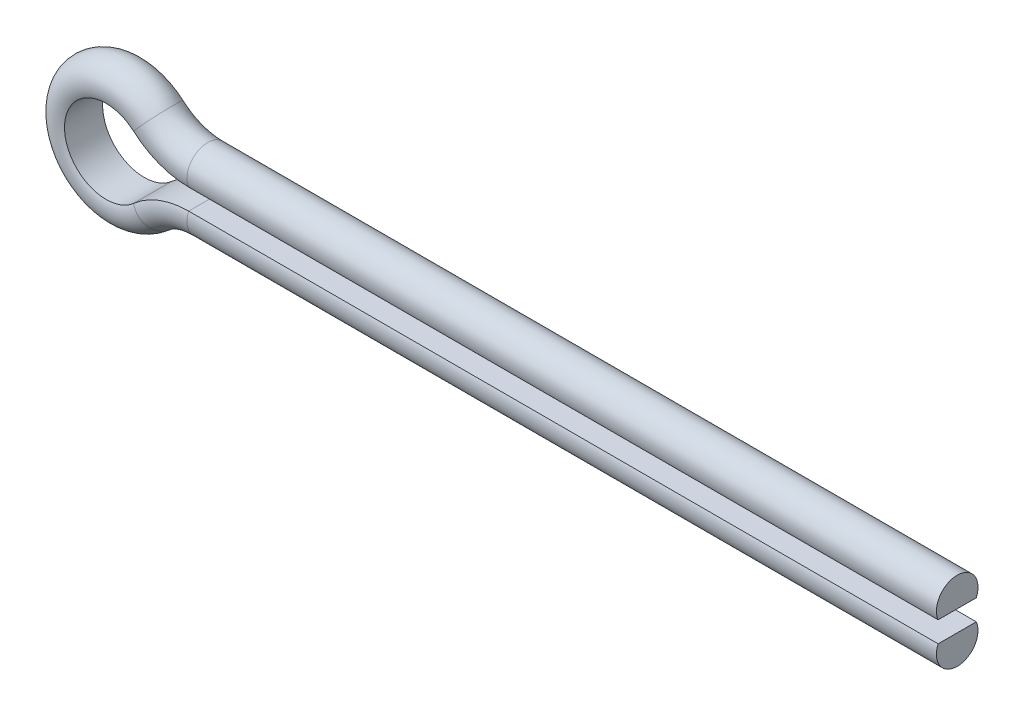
from build123d import *


with BuildPart() as part:
    # Sweep1: sweep along a path in Sketch1
    with BuildLine(Plane.XY) as sweep1_path:
        Line((0, 0), (-90.078432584, 0))
        ThreePointArc((-90.078432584, 0), (-93.613966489, -0.645856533), (-96.692810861, -2.5))
        ThreePointArc((-96.692810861, -2.5), (-105, 1.25), (-96.692810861, 5))
        ThreePointArc((-96.692810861, 5), (-93.613966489, 3.145856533), (-90.078432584, 2.5))
        Line((-90.078432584, 2.5), (0, 2.5))
    # Sketch2 → Sweep1 (sweep)
    with BuildSketch(Plane(origin=(0, 0, 0), x_dir=(0, 0, -1), z_dir=(1, 0, 0))):
        with BuildLine():
            Line((2.291287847, 0), (-2.291287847, 0))
            ThreePointArc((-2.291287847, 0), (0, -3.5), (2.291287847, 0))
        make_face()
    sweep(path=sweep1_path.line)


solid = part.part
